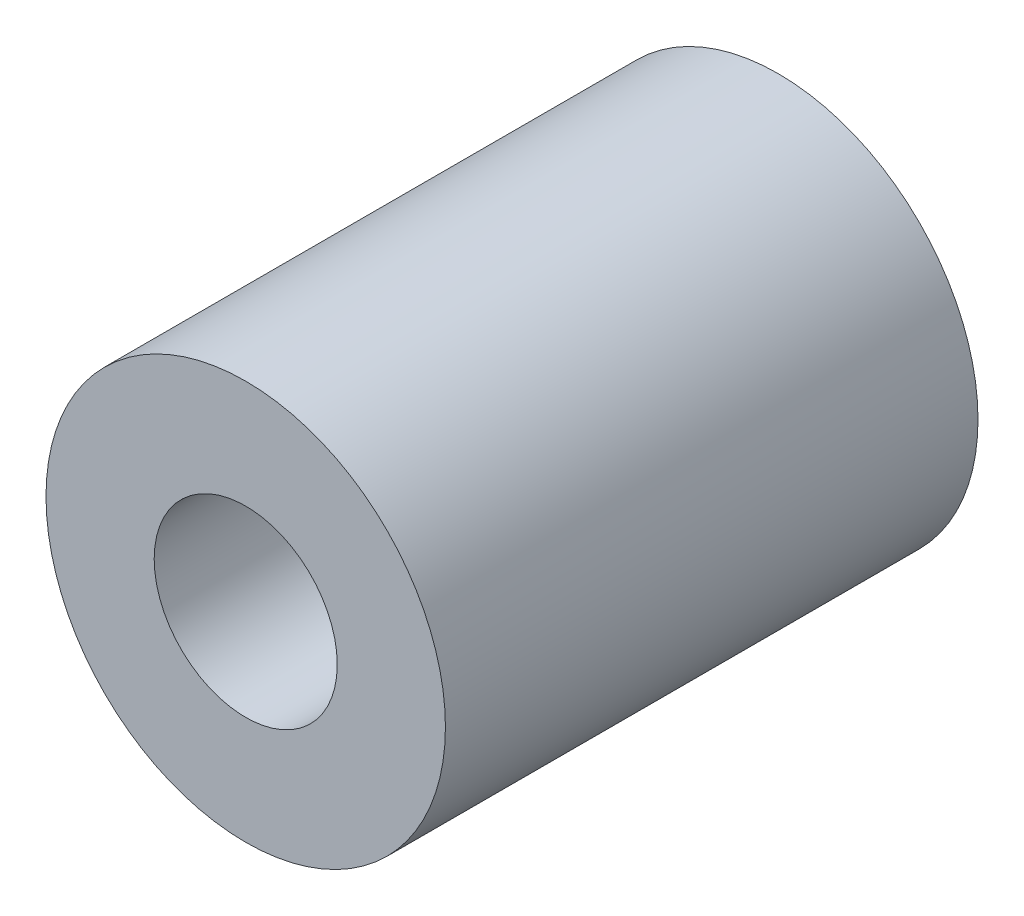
from build123d import *

# Parameters (mm, degrees)
SKETCH_1_R          = 6
EXTRUDE_1_DEPTH     = 16
SKETCH_2_R          = 2.75
CUT_EXTRUDE_1_DEPTH = 16


with BuildPart() as part:
    # Sketch 1 → Extrude 1 (new body)
    with BuildSketch(Plane.XY):
        Circle(SKETCH_1_R)
    extrude(amount=EXTRUDE_1_DEPTH)

    # Sketch 2 → Cut-Extrude 1 (cut)
    with BuildSketch(Plane.XY.offset(16)):
        Circle(SKETCH_2_R)
    extrude(amount=-CUT_EXTRUDE_1_DEPTH, mode=Mode.SUBTRACT)


solid = part.part
